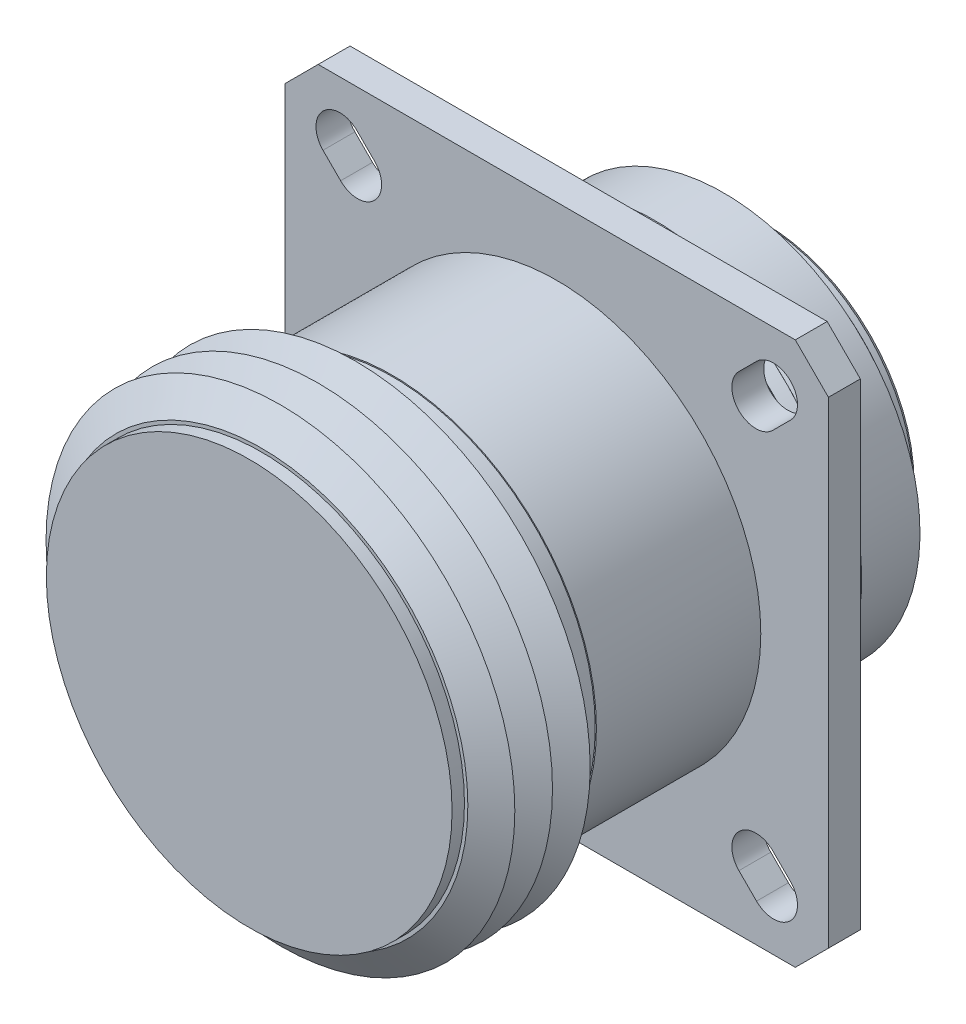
from build123d import *

# Parameters (mm, degrees)
SKETCH1_W           = 36.8046
SKETCH1_H           = 36.8046
BOSS_EXTRUDE1_DEPTH = 2.159
CUT_EXTRUDE1_DEPTH  = 27.114183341


with BuildPart() as part:
    # Sketch1 → Boss-Extrude1 (new body)
    with BuildSketch(Plane.XY):
        Rectangle(SKETCH1_W, SKETCH1_H)
    extrude(amount=-BOSS_EXTRUDE1_DEPTH)

    # Sketch2 → Cut-Extrude1 (cut, through all)
    with BuildSketch(Plane.XY):
        Polygon((16.15723597, 18.4023), (18.4023, 16.15723597), (18.4023, 18.4023), align=None)
        with BuildLine():
            Line((14.636872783, -12.337927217), (15.830672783, -13.531727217))
            ThreePointArc((15.830672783, -13.531727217), (15.830672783, -15.830672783), (13.531727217, -15.830672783))
            Line((13.531727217, -15.830672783), (12.337927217, -14.636872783))
            ThreePointArc((12.337927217, -14.636872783), (12.337927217, -12.337927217), (14.636872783, -12.337927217))
        make_face()
        with BuildLine():
            Line((-14.636872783, -12.337927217), (-15.830672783, -13.531727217))
            ThreePointArc((-15.830672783, -13.531727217), (-15.830672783, -15.830672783), (-13.531727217, -15.830672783))
            Line((-13.531727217, -15.830672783), (-12.337927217, -14.636872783))
            ThreePointArc((-12.337927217, -14.636872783), (-12.337927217, -12.337927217), (-14.636872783, -12.337927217))
        make_face()
        Polygon((-18.4023, 18.4023), (-16.15723597, 18.4023), (-18.4023, 16.15723597), align=None)
    cut_extrude1 = extrude(amount=-CUT_EXTRUDE1_DEPTH, mode=Mode.SUBTRACT)

    # Mirror2: Cut-Extrude1 across plane
    add(cut_extrude1.mirror(Plane.ZX), mode=Mode.SUBTRACT)

    # Sketch3 → Revolve1 (revolve)
    with BuildSketch(Plane(origin=(0, 0, 0), x_dir=(0, 0, -1), z_dir=(1, 0, 0)), mode=Mode.PRIVATE) as revolve1_sk:
        Polygon((0, 13.820358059), (-11.132628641, 13.820358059), (-11.132628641, 13.74015413), (-12.334975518, 13.74015413), (-12.334975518, 13.968756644), (-13.610599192, 15.875), (-14.886222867, 13.968756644), (-16.161846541, 15.875), (-17.437470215, 13.968756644), (-18.71309389, 15.875), (-19.988717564, 13.968756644), (-19.988717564, 13.74015413), (-20.828, 13.74015413), (-20.828, 0), (0, 0), align=None)
    revolve(revolve1_sk.sketch.rotate(Axis((0, 0, 0), (0, 0, -1)), 90), axis=Axis((0, 0, 0), (0, 0, -1)))

    # Sketch4 → M28 x 1.0 (revolve)
    with BuildSketch(Plane(origin=(0, 0, 0), x_dir=(0, 0, -1), z_dir=(1, 0, 0)), mode=Mode.PRIVATE) as m28_x_1_0_sk:
        Polygon((2.159, 0), (2.159, 14.814815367), (3.541716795, 14.814815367), (3.541716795, 13.296), (4.154849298, 13.296), (4.654849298, 14), (5.154849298, 13.296), (5.654849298, 14), (6.154849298, 13.296), (6.654849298, 14), (7.154849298, 13.296), (11.307277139, 13.296), (13.454353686, 10.272916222), (13.86754842, 10.272916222), (14.0716, 10.127993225), (14.0716, 0), align=None)
    revolve(m28_x_1_0_sk.sketch.rotate(Axis((0, 0, -14.0716), (0, 0, -1)), 180), axis=Axis((0, 0, -14.0716), (0, 0, -1)))


solid = part.part
